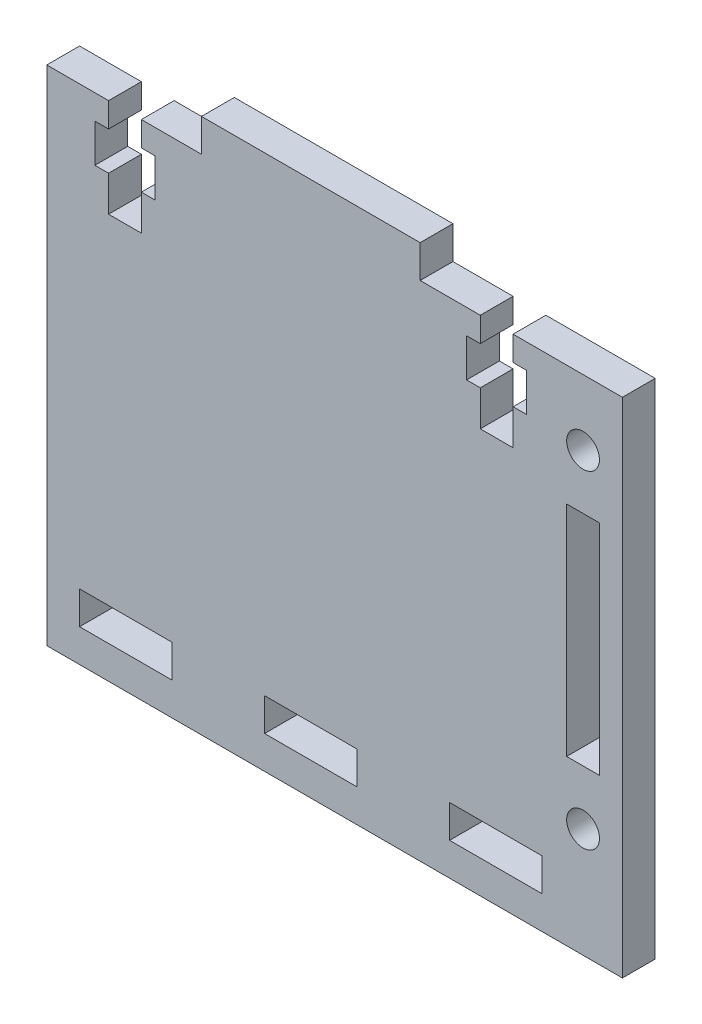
from build123d import *

# Parameters (mm, degrees)
SKETCH2_W           = 8.46
SKETCH2_H           = 3
SKETCH2_R           = 1.5
SKETCH2_W_2         = 3
SKETCH2_H_2         = 20
BOSS_EXTRUDE1_DEPTH = 3


with BuildPart() as part:
    # Sketch2 → Boss-Extrude1 (new body)
    with BuildSketch(Plane.XY):
        Polygon((-17.675, 12.5), (-20.675, 12.5), (-20.675, 15.75), (-21.925, 15.75), (-21.925, 19.25), (-20.675, 19.25), (-20.675, 21.5), (-26.325, 21.5), (-26.325, -24.5), (26.325, -24.5), (26.325, 21.5), (16.325, 21.5), (16.325, 19.25), (17.575, 19.25), (17.575, 15.75), (16.325, 15.75), (16.325, 12.5), (13.325, 12.5), (13.325, 15.75), (12.075, 15.75), (12.075, 19.25), (13.325, 19.25), (13.325, 21.5), (7.825, 21.5), (7.825, 24.5), (-12.175, 24.5), (-12.175, 21.5), (-17.675, 21.5), (-17.675, 19.25), (-16.425, 19.25), (-16.425, 15.75), (-17.675, 15.75), align=None)
        with Locations((-19.095, -20)):
            Rectangle(SKETCH2_W, SKETCH2_H, mode=Mode.SUBTRACT)
        with Locations((-2.175, -20)):
            Rectangle(SKETCH2_W, SKETCH2_H, mode=Mode.SUBTRACT)
        with Locations((14.745, -20)):
            Rectangle(SKETCH2_W, SKETCH2_H, mode=Mode.SUBTRACT)
        with Locations((22.725, -14.5)):
            Circle(SKETCH2_R, mode=Mode.SUBTRACT)
        with Locations((22.725, 0.5)):
            Rectangle(SKETCH2_W_2, SKETCH2_H_2, mode=Mode.SUBTRACT)
        with Locations((22.725, 15.5)):
            Circle(SKETCH2_R, mode=Mode.SUBTRACT)
    extrude(amount=BOSS_EXTRUDE1_DEPTH)


solid = part.part
